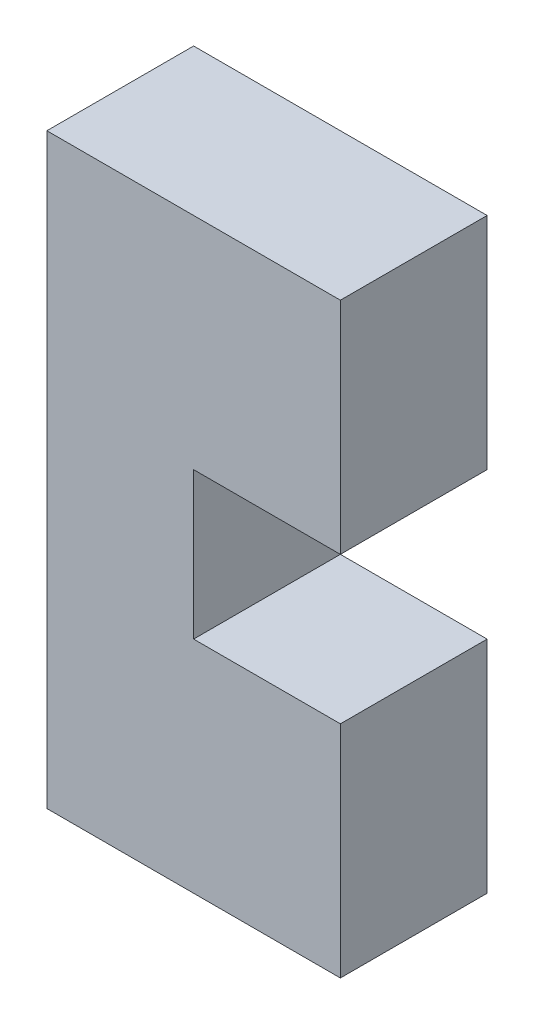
from build123d import *

# Parameters (mm, degrees)
BOSS_EXTRU_1_DEPTH = 5


with BuildPart() as part:
    # Esquisse1 → Boss.-Extru.1 (new body)
    with BuildSketch(Plane.XY):
        Polygon((-5, 10), (5, 10), (5, 2.5), (0, 2.5), (0, -2.5), (5, -2.5), (5, -10), (-5, -10), align=None)
    extrude(amount=BOSS_EXTRU_1_DEPTH)


solid = part.part
